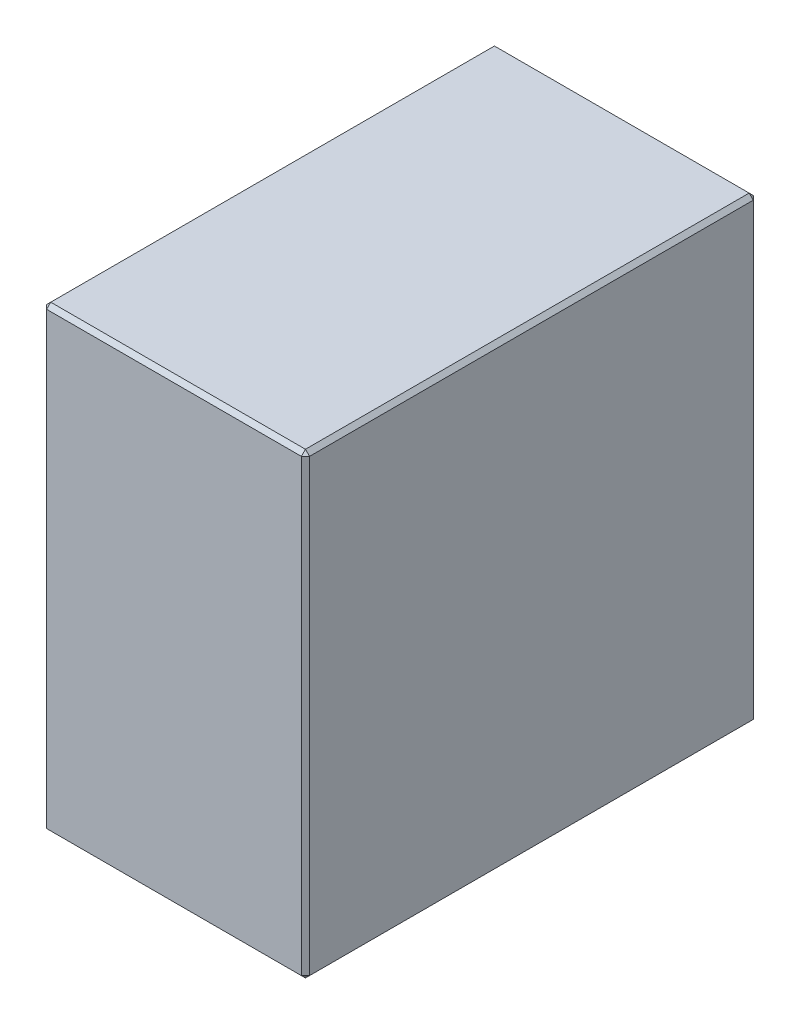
ISO-10303-21;
HEADER;
FILE_DESCRIPTION(('STEP AP214'),'2;1');
FILE_NAME('part.step','',(''),(''),'','','');
FILE_SCHEMA(('AUTOMOTIVE_DESIGN { 1 0 10303 214 1 1 1 1 }'));
ENDSEC;
DATA;
#1=APPLICATION_CONTEXT('core data for automotive mechanical design processes');
#2=APPLICATION_PROTOCOL_DEFINITION('international standard','automotive_design',2000,#1);
#3=PRODUCT_CONTEXT('',#1,'mechanical');
#4=PRODUCT('Part','Part','',(#3));
#5=PRODUCT_RELATED_PRODUCT_CATEGORY('part','',(#4));
#6=PRODUCT_DEFINITION_FORMATION('','',#4);
#7=PRODUCT_DEFINITION_CONTEXT('part definition',#1,'design');
#8=PRODUCT_DEFINITION('design','',#6,#7);
#9=PRODUCT_DEFINITION_SHAPE('','',#8);
#10=(LENGTH_UNIT() NAMED_UNIT(*) SI_UNIT(.MILLI.,.METRE.));
#11=(NAMED_UNIT(*) PLANE_ANGLE_UNIT() SI_UNIT($,.RADIAN.));
#12=(NAMED_UNIT(*) SI_UNIT($,.STERADIAN.) SOLID_ANGLE_UNIT());
#13=UNCERTAINTY_MEASURE_WITH_UNIT(LENGTH_MEASURE(1.E-05),#10,'distance_accuracy_value','');
#14=(GEOMETRIC_REPRESENTATION_CONTEXT(3) GLOBAL_UNCERTAINTY_ASSIGNED_CONTEXT((#13)) GLOBAL_UNIT_ASSIGNED_CONTEXT((#10,
#11,#12)) REPRESENTATION_CONTEXT('',''));
#15=CARTESIAN_POINT('',(0.,0.,0.));
#16=DIRECTION('',(0.,0.,1.));
#17=DIRECTION('',(1.,0.,0.));
#18=AXIS2_PLACEMENT_3D('',#15,#16,#17);
#19=CARTESIAN_POINT('',(27.,27.5,-27.5));
#20=DIRECTION('',(0.,-1.,0.));
#21=DIRECTION('',(0.,0.,-1.));
#22=AXIS2_PLACEMENT_3D('',#19,#20,#21);
#23=PLANE('',#22);
#24=DIRECTION('',(1.,0.,0.));
#25=VECTOR('',#24,1.);
#26=CARTESIAN_POINT('',(27.,27.5,27.));
#27=LINE('',#26,#25);
#28=CARTESIAN_POINT('',(-4.50000000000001,27.5,27.));
#29=VERTEX_POINT('',#28);
#30=CARTESIAN_POINT('',(26.5,27.5,27.));
#31=VERTEX_POINT('',#30);
#32=EDGE_CURVE('E412',#29,#31,#27,.T.);
#33=ORIENTED_EDGE('',*,*,#32,.T.);
#34=DIRECTION('',(0.,0.,-1.));
#35=VECTOR('',#34,1.);
#36=CARTESIAN_POINT('',(26.5,27.5,-27.5));
#37=LINE('',#36,#35);
#38=CARTESIAN_POINT('',(26.5,27.5,-27.));
#39=VERTEX_POINT('',#38);
#40=EDGE_CURVE('E415',#31,#39,#37,.T.);
#41=ORIENTED_EDGE('',*,*,#40,.T.);
#42=DIRECTION('',(-1.,0.,0.));
#43=VECTOR('',#42,1.);
#44=CARTESIAN_POINT('',(27.,27.5,-27.));
#45=LINE('',#44,#43);
#46=CARTESIAN_POINT('',(-4.50000000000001,27.5,-27.));
#47=VERTEX_POINT('',#46);
#48=EDGE_CURVE('E334',#39,#47,#45,.T.);
#49=ORIENTED_EDGE('',*,*,#48,.T.);
#50=DIRECTION('',(0.,0.,1.));
#51=VECTOR('',#50,1.);
#52=CARTESIAN_POINT('',(-4.50000000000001,27.5,-27.5));
#53=LINE('',#52,#51);
#54=EDGE_CURVE('E416',#47,#29,#53,.T.);
#55=ORIENTED_EDGE('',*,*,#54,.T.);
#56=EDGE_LOOP('',(#33,#41,#49,#55));
#57=FACE_BOUND('',#56,.T.);
#58=ADVANCED_FACE('F31',(#57),#23,.F.);
#59=CARTESIAN_POINT('',(27.,-0.870419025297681,27.5));
#60=DIRECTION('',(0.,0.,-1.));
#61=DIRECTION('',(-1.,0.,0.));
#62=AXIS2_PLACEMENT_3D('',#59,#60,#61);
#63=PLANE('',#62);
#64=DIRECTION('',(1.,0.,0.));
#65=VECTOR('',#64,1.);
#66=CARTESIAN_POINT('',(27.,-27.7295705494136,27.5));
#67=LINE('',#66,#65);
#68=CARTESIAN_POINT('',(-4.50000000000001,-27.7295705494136,27.5));
#69=VERTEX_POINT('',#68);
#70=CARTESIAN_POINT('',(26.5,-27.7295705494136,27.5));
#71=VERTEX_POINT('',#70);
#72=EDGE_CURVE('E312',#69,#71,#67,.T.);
#73=ORIENTED_EDGE('',*,*,#72,.T.);
#74=DIRECTION('',(0.,1.,0.));
#75=VECTOR('',#74,1.);
#76=CARTESIAN_POINT('',(26.5,27.5,27.5));
#77=LINE('',#76,#75);
#78=CARTESIAN_POINT('',(26.5,27.,27.5));
#79=VERTEX_POINT('',#78);
#80=EDGE_CURVE('E178',#71,#79,#77,.T.);
#81=ORIENTED_EDGE('',*,*,#80,.T.);
#82=DIRECTION('',(-1.,0.,0.));
#83=VECTOR('',#82,1.);
#84=CARTESIAN_POINT('',(27.,27.,27.5));
#85=LINE('',#84,#83);
#86=CARTESIAN_POINT('',(-4.50000000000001,27.,27.5));
#87=VERTEX_POINT('',#86);
#88=EDGE_CURVE('E378',#79,#87,#85,.T.);
#89=ORIENTED_EDGE('',*,*,#88,.T.);
#90=DIRECTION('',(0.,-1.,0.));
#91=VECTOR('',#90,1.);
#92=CARTESIAN_POINT('',(-4.50000000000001,-0.870419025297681,27.5));
#93=LINE('',#92,#91);
#94=EDGE_CURVE('E314',#87,#69,#93,.T.);
#95=ORIENTED_EDGE('',*,*,#94,.T.);
#96=EDGE_LOOP('',(#73,#81,#89,#95));
#97=FACE_BOUND('',#96,.T.);
#98=ADVANCED_FACE('F303',(#97),#63,.F.);
#99=CARTESIAN_POINT('',(27.,-28.2295705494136,-27.5));
#100=DIRECTION('',(0.,1.,0.));
#101=DIRECTION('',(0.,0.,1.));
#102=AXIS2_PLACEMENT_3D('',#99,#100,#101);
#103=PLANE('',#102);
#104=DIRECTION('',(1.,0.,0.));
#105=VECTOR('',#104,1.);
#106=CARTESIAN_POINT('',(27.,-28.2295705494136,-27.));
#107=LINE('',#106,#105);
#108=CARTESIAN_POINT('',(-4.50000000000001,-28.2295705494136,-27.));
#109=VERTEX_POINT('',#108);
#110=CARTESIAN_POINT('',(26.5,-28.2295705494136,-27.));
#111=VERTEX_POINT('',#110);
#112=EDGE_CURVE('E370',#109,#111,#107,.T.);
#113=ORIENTED_EDGE('',*,*,#112,.T.);
#114=DIRECTION('',(0.,0.,1.));
#115=VECTOR('',#114,1.);
#116=CARTESIAN_POINT('',(26.5,-28.2295705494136,27.5));
#117=LINE('',#116,#115);
#118=CARTESIAN_POINT('',(26.5,-28.2295705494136,27.));
#119=VERTEX_POINT('',#118);
#120=EDGE_CURVE('E391',#111,#119,#117,.T.);
#121=ORIENTED_EDGE('',*,*,#120,.T.);
#122=DIRECTION('',(-1.,0.,0.));
#123=VECTOR('',#122,1.);
#124=CARTESIAN_POINT('',(27.,-28.2295705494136,27.));
#125=LINE('',#124,#123);
#126=CARTESIAN_POINT('',(-4.50000000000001,-28.2295705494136,27.));
#127=VERTEX_POINT('',#126);
#128=EDGE_CURVE('E318',#119,#127,#125,.T.);
#129=ORIENTED_EDGE('',*,*,#128,.T.);
#130=DIRECTION('',(0.,0.,-1.));
#131=VECTOR('',#130,1.);
#132=CARTESIAN_POINT('',(-4.50000000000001,-28.2295705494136,-27.5));
#133=LINE('',#132,#131);
#134=EDGE_CURVE('E387',#127,#109,#133,.T.);
#135=ORIENTED_EDGE('',*,*,#134,.T.);
#136=EDGE_LOOP('',(#113,#121,#129,#135));
#137=FACE_BOUND('',#136,.T.);
#138=ADVANCED_FACE('F300',(#137),#103,.F.);
#139=CARTESIAN_POINT('',(27.,-0.89256496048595,-27.5));
#140=DIRECTION('',(0.,0.,1.));
#141=DIRECTION('',(0.,-1.,0.));
#142=AXIS2_PLACEMENT_3D('',#139,#140,#141);
#143=PLANE('',#142);
#144=DIRECTION('',(-1.,0.,0.));
#145=VECTOR('',#144,1.);
#146=CARTESIAN_POINT('',(27.,-0.89256496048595,-27.5));
#147=LINE('',#146,#145);
#148=CARTESIAN_POINT('',(26.5,-0.89256496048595,-27.5));
#149=VERTEX_POINT('',#148);
#150=CARTESIAN_POINT('',(-4.50000000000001,-0.89256496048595,-27.5));
#151=VERTEX_POINT('',#150);
#152=EDGE_CURVE('E165',#149,#151,#147,.T.);
#153=ORIENTED_EDGE('',*,*,#152,.F.);
#154=DIRECTION('',(0.,-1.,0.));
#155=VECTOR('',#154,1.);
#156=CARTESIAN_POINT('',(26.5,-28.2295705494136,-27.5));
#157=LINE('',#156,#155);
#158=CARTESIAN_POINT('',(26.5,-27.7295705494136,-27.5));
#159=VERTEX_POINT('',#158);
#160=EDGE_CURVE('E375',#149,#159,#157,.T.);
#161=ORIENTED_EDGE('',*,*,#160,.T.);
#162=DIRECTION('',(-1.,0.,0.));
#163=VECTOR('',#162,1.);
#164=CARTESIAN_POINT('',(27.,-27.7295705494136,-27.5));
#165=LINE('',#164,#163);
#166=CARTESIAN_POINT('',(-4.50000000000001,-27.7295705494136,-27.5));
#167=VERTEX_POINT('',#166);
#168=EDGE_CURVE('E371',#159,#167,#165,.T.);
#169=ORIENTED_EDGE('',*,*,#168,.T.);
#170=DIRECTION('',(0.,1.,0.));
#171=VECTOR('',#170,1.);
#172=CARTESIAN_POINT('',(-4.50000000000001,-0.89256496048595,-27.5));
#173=LINE('',#172,#171);
#174=EDGE_CURVE('E376',#167,#151,#173,.T.);
#175=ORIENTED_EDGE('',*,*,#174,.T.);
#176=EDGE_LOOP('',(#153,#161,#169,#175));
#177=FACE_BOUND('',#176,.T.);
#178=ADVANCED_FACE('F296',(#177),#143,.F.);
#179=CARTESIAN_POINT('',(27.,0.0789321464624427,-0.0171654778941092));
#180=DIRECTION('',(-1.,0.,0.));
#181=DIRECTION('',(0.,0.,1.));
#182=AXIS2_PLACEMENT_3D('',#179,#180,#181);
#183=CYLINDRICAL_SURFACE('',#182,27.4999999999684);
#184=DIRECTION('',(-1.,0.,0.));
#185=VECTOR('',#184,1.);
#186=CARTESIAN_POINT('',(27.,1.05042925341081,-27.5));
#187=LINE('',#186,#185);
#188=CARTESIAN_POINT('',(26.5,1.05042925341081,-27.5));
#189=VERTEX_POINT('',#188);
#190=CARTESIAN_POINT('',(-4.5,1.05042925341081,-27.5));
#191=VERTEX_POINT('',#190);
#192=EDGE_CURVE('E434',#189,#191,#187,.T.);
#193=ORIENTED_EDGE('',*,*,#192,.F.);
#194=CARTESIAN_POINT('',(26.5,0.0789321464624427,-0.0171654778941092));
#195=DIRECTION('',(1.,0.,0.));
#196=DIRECTION('',(0.,0.,-1.));
#197=AXIS2_PLACEMENT_3D('',#194,#195,#196);
#198=CIRCLE('',#197,27.4999999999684);
#199=EDGE_CURVE('E380',#189,#149,#198,.F.);
#200=ORIENTED_EDGE('',*,*,#199,.T.);
#201=ORIENTED_EDGE('',*,*,#152,.T.);
#202=CARTESIAN_POINT('',(-4.50000000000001,0.0789321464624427,-0.0171654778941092));
#203=DIRECTION('',(1.,0.,0.));
#204=DIRECTION('',(0.,0.,-1.));
#205=AXIS2_PLACEMENT_3D('',#202,#203,#204);
#206=CIRCLE('',#205,27.4999999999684);
#207=EDGE_CURVE('E428',#151,#191,#206,.T.);
#208=ORIENTED_EDGE('',*,*,#207,.T.);
#209=EDGE_LOOP('',(#193,#200,#201,#208));
#210=FACE_BOUND('',#209,.T.);
#211=ADVANCED_FACE('F292',(#210),#183,.T.);
#212=CARTESIAN_POINT('',(27.,1.05042925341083,-27.5));
#213=DIRECTION('',(0.,0.,1.));
#214=DIRECTION('',(1.,0.,0.));
#215=AXIS2_PLACEMENT_3D('',#212,#213,#214);
#216=PLANE('',#215);
#217=DIRECTION('',(1.,0.,0.));
#218=VECTOR('',#217,1.);
#219=CARTESIAN_POINT('',(27.,27.,-27.5));
#220=LINE('',#219,#218);
#221=CARTESIAN_POINT('',(-4.5,27.,-27.5));
#222=VERTEX_POINT('',#221);
#223=CARTESIAN_POINT('',(26.5,27.,-27.5));
#224=VERTEX_POINT('',#223);
#225=EDGE_CURVE('E336',#222,#224,#220,.T.);
#226=ORIENTED_EDGE('',*,*,#225,.T.);
#227=DIRECTION('',(0.,-1.,0.));
#228=VECTOR('',#227,1.);
#229=CARTESIAN_POINT('',(26.5,1.05042925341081,-27.5));
#230=LINE('',#229,#228);
#231=EDGE_CURVE('E425',#224,#189,#230,.T.);
#232=ORIENTED_EDGE('',*,*,#231,.T.);
#233=ORIENTED_EDGE('',*,*,#192,.T.);
#234=DIRECTION('',(0.,1.,0.));
#235=VECTOR('',#234,1.);
#236=CARTESIAN_POINT('',(-4.5,1.05042925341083,-27.5));
#237=LINE('',#236,#235);
#238=EDGE_CURVE('E423',#191,#222,#237,.T.);
#239=ORIENTED_EDGE('',*,*,#238,.T.);
#240=EDGE_LOOP('',(#226,#232,#233,#239));
#241=FACE_BOUND('',#240,.T.);
#242=ADVANCED_FACE('F289',(#241),#216,.F.);
#243=CARTESIAN_POINT('',(27.,0.0789321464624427,-0.0171654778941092));
#244=DIRECTION('',(1.,0.,0.));
#245=DIRECTION('',(0.,0.,-1.));
#246=AXIS2_PLACEMENT_3D('',#243,#244,#245);
#247=PLANE('',#246);
#248=DIRECTION('',(0.,1.,0.));
#249=VECTOR('',#248,1.);
#250=CARTESIAN_POINT('',(27.,27.5,-27.));
#251=LINE('',#250,#249);
#252=CARTESIAN_POINT('',(27.,1.04155416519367,-27.));
#253=VERTEX_POINT('',#252);
#254=CARTESIAN_POINT('',(27.,27.,-27.));
#255=VERTEX_POINT('',#254);
#256=EDGE_CURVE('E442',#253,#255,#251,.T.);
#257=ORIENTED_EDGE('',*,*,#256,.T.);
#258=DIRECTION('',(0.,0.,1.));
#259=VECTOR('',#258,1.);
#260=CARTESIAN_POINT('',(27.,27.,27.5));
#261=LINE('',#260,#259);
#262=CARTESIAN_POINT('',(27.,27.,27.));
#263=VERTEX_POINT('',#262);
#264=EDGE_CURVE('E149',#255,#263,#261,.T.);
#265=ORIENTED_EDGE('',*,*,#264,.T.);
#266=DIRECTION('',(0.,-1.,0.));
#267=VECTOR('',#266,1.);
#268=CARTESIAN_POINT('',(27.,-28.2295705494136,27.));
#269=LINE('',#268,#267);
#270=CARTESIAN_POINT('',(27.,-27.7295705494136,27.));
#271=VERTEX_POINT('',#270);
#272=EDGE_CURVE('E143',#263,#271,#269,.T.);
#273=ORIENTED_EDGE('',*,*,#272,.T.);
#274=DIRECTION('',(0.,0.,-1.));
#275=VECTOR('',#274,1.);
#276=CARTESIAN_POINT('',(27.,-27.7295705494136,-27.5));
#277=LINE('',#276,#275);
#278=CARTESIAN_POINT('',(27.,-27.7295705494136,-27.));
#279=VERTEX_POINT('',#278);
#280=EDGE_CURVE('E146',#271,#279,#277,.T.);
#281=ORIENTED_EDGE('',*,*,#280,.T.);
#282=DIRECTION('',(0.,1.,0.));
#283=VECTOR('',#282,1.);
#284=CARTESIAN_POINT('',(27.,-0.89256496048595,-27.));
#285=LINE('',#284,#283);
#286=CARTESIAN_POINT('',(27.,-0.883689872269,-27.));
#287=VERTEX_POINT('',#286);
#288=EDGE_CURVE('E153',#279,#287,#285,.T.);
#289=ORIENTED_EDGE('',*,*,#288,.T.);
#290=CARTESIAN_POINT('',(27.,0.0789321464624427,-0.0171654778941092));
#291=DIRECTION('',(1.,0.,0.));
#292=DIRECTION('',(0.,0.,-1.));
#293=AXIS2_PLACEMENT_3D('',#290,#291,#292);
#294=CIRCLE('',#293,26.9999999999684);
#295=EDGE_CURVE('E440',#287,#253,#294,.T.);
#296=ORIENTED_EDGE('',*,*,#295,.T.);
#297=EDGE_LOOP('',(#257,#265,#273,#281,#289,#296));
#298=FACE_BOUND('',#297,.T.);
#299=ADVANCED_FACE('F145',(#298),#247,.T.);
#300=CARTESIAN_POINT('',(-5.,0.0789321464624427,-0.0171654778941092));
#301=DIRECTION('',(1.,0.,0.));
#302=DIRECTION('',(0.,0.,-1.));
#303=AXIS2_PLACEMENT_3D('',#300,#301,#302);
#304=PLANE('',#303);
#305=DIRECTION('',(0.,-1.,0.));
#306=VECTOR('',#305,1.);
#307=CARTESIAN_POINT('',(-5.,0.0789321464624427,-27.));
#308=LINE('',#307,#306);
#309=CARTESIAN_POINT('',(-5.,27.,-27.));
#310=VERTEX_POINT('',#309);
#311=CARTESIAN_POINT('',(-5.,1.04155416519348,-27.));
#312=VERTEX_POINT('',#311);
#313=EDGE_CURVE('E393',#310,#312,#308,.T.);
#314=ORIENTED_EDGE('',*,*,#313,.T.);
#315=CARTESIAN_POINT('',(-5.,0.0789321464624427,-0.0171654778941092));
#316=DIRECTION('',(1.,0.,0.));
#317=DIRECTION('',(0.,0.,-1.));
#318=AXIS2_PLACEMENT_3D('',#315,#316,#317);
#319=CIRCLE('',#318,26.9999999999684);
#320=CARTESIAN_POINT('',(-5.,-0.883689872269,-27.));
#321=VERTEX_POINT('',#320);
#322=EDGE_CURVE('E11',#312,#321,#319,.F.);
#323=ORIENTED_EDGE('',*,*,#322,.T.);
#324=DIRECTION('',(0.,-1.,0.));
#325=VECTOR('',#324,1.);
#326=CARTESIAN_POINT('',(-5.,0.0789321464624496,-27.));
#327=LINE('',#326,#325);
#328=CARTESIAN_POINT('',(-5.,-27.7295705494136,-27.));
#329=VERTEX_POINT('',#328);
#330=EDGE_CURVE('E38',#321,#329,#327,.T.);
#331=ORIENTED_EDGE('',*,*,#330,.T.);
#332=DIRECTION('',(0.,0.,1.));
#333=VECTOR('',#332,1.);
#334=CARTESIAN_POINT('',(-5.,-27.7295705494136,-0.0171654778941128));
#335=LINE('',#334,#333);
#336=CARTESIAN_POINT('',(-5.,-27.7295705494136,27.));
#337=VERTEX_POINT('',#336);
#338=EDGE_CURVE('E399',#329,#337,#335,.T.);
#339=ORIENTED_EDGE('',*,*,#338,.T.);
#340=DIRECTION('',(0.,1.,0.));
#341=VECTOR('',#340,1.);
#342=CARTESIAN_POINT('',(-5.,0.0789321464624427,27.));
#343=LINE('',#342,#341);
#344=CARTESIAN_POINT('',(-5.,27.,27.));
#345=VERTEX_POINT('',#344);
#346=EDGE_CURVE('E397',#337,#345,#343,.T.);
#347=ORIENTED_EDGE('',*,*,#346,.T.);
#348=DIRECTION('',(0.,0.,-1.));
#349=VECTOR('',#348,1.);
#350=CARTESIAN_POINT('',(-5.,27.,-0.0171654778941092));
#351=LINE('',#350,#349);
#352=EDGE_CURVE('E395',#345,#310,#351,.T.);
#353=ORIENTED_EDGE('',*,*,#352,.T.);
#354=EDGE_LOOP('',(#314,#323,#331,#339,#347,#353));
#355=FACE_BOUND('',#354,.T.);
#356=ADVANCED_FACE('F283',(#355),#304,.F.);
#357=CARTESIAN_POINT('',(-4.50000000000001,-27.7295705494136,-27.5));
#358=DIRECTION('',(-0.577350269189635,-0.577350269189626,-0.577350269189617));
#359=DIRECTION('',(0.707106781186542,-0.707106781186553,0.));
#360=AXIS2_PLACEMENT_3D('',#357,#358,#359);
#361=PLANE('',#360);
#362=DIRECTION('',(0.707106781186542,-0.707106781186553,0.));
#363=VECTOR('',#362,1.);
#364=CARTESIAN_POINT('',(-4.75,-27.9795705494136,-27.));
#365=LINE('',#364,#363);
#366=EDGE_CURVE('E264',#329,#109,#365,.T.);
#367=ORIENTED_EDGE('',*,*,#366,.F.);
#368=DIRECTION('',(-0.707106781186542,0.,0.707106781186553));
#369=VECTOR('',#368,1.);
#370=CARTESIAN_POINT('',(-4.50000000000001,-27.7295705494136,-27.5));
#371=LINE('',#370,#369);
#372=EDGE_CURVE('E448',#167,#329,#371,.T.);
#373=ORIENTED_EDGE('',*,*,#372,.F.);
#374=DIRECTION('',(0.,0.707106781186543,-0.707106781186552));
#375=VECTOR('',#374,1.);
#376=CARTESIAN_POINT('',(-4.50000000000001,-27.7295705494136,-27.5));
#377=LINE('',#376,#375);
#378=EDGE_CURVE('E373',#109,#167,#377,.T.);
#379=ORIENTED_EDGE('',*,*,#378,.F.);
#380=EDGE_LOOP('',(#367,#373,#379));
#381=FACE_BOUND('',#380,.T.);
#382=ADVANCED_FACE('F273',(#381),#361,.T.);
#383=CARTESIAN_POINT('',(-4.50000000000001,-0.89256496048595,-27.5));
#384=DIRECTION('',(0.707106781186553,0.,0.707106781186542));
#385=DIRECTION('',(0.707106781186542,0.,-0.707106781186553));
#386=AXIS2_PLACEMENT_3D('',#383,#384,#385);
#387=PLANE('',#386);
#388=ORIENTED_EDGE('',*,*,#372,.T.);
#389=ORIENTED_EDGE('',*,*,#330,.F.);
#390=CARTESIAN_POINT('',(-5.,-0.883689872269,-27.));
#391=CARTESIAN_POINT('',(-4.91666672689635,-0.885175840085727,-27.0833332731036));
#392=CARTESIAN_POINT('',(-4.83333342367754,-0.886658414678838,-27.1666665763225));
#393=CARTESIAN_POINT('',(-4.66666675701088,-0.889616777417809,-27.3333332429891));
#394=CARTESIAN_POINT('',(-4.58333339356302,-0.891092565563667,-27.416666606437));
#395=CARTESIAN_POINT('',(-4.50000000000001,-0.892564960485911,-27.5));
#396=B_SPLINE_CURVE_WITH_KNOTS('',3,(#390,#391,#392,#393,#394,#395),.UNSPECIFIED.,.F.,.F.,(4,2,
4),(0.,0.353581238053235,0.70716247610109),.UNSPECIFIED.);
#397=EDGE_CURVE('E45',#151,#321,#396,.F.);
#398=ORIENTED_EDGE('',*,*,#397,.F.);
#399=ORIENTED_EDGE('',*,*,#174,.F.);
#400=EDGE_LOOP('',(#388,#389,#398,#399));
#401=FACE_BOUND('',#400,.T.);
#402=ADVANCED_FACE('F267',(#401),#387,.F.);
#403=CARTESIAN_POINT('',(27.,-27.7295705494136,-27.5));
#404=DIRECTION('',(0.,0.707106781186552,0.707106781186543));
#405=DIRECTION('',(0.,-0.707106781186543,0.707106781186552));
#406=AXIS2_PLACEMENT_3D('',#403,#404,#405);
#407=PLANE('',#406);
#408=ORIENTED_EDGE('',*,*,#378,.T.);
#409=ORIENTED_EDGE('',*,*,#168,.F.);
#410=DIRECTION('',(0.,-0.707106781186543,0.707106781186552));
#411=VECTOR('',#410,1.);
#412=CARTESIAN_POINT('',(26.5,-27.7295705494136,-27.5));
#413=LINE('',#412,#411);
#414=EDGE_CURVE('E265',#111,#159,#413,.F.);
#415=ORIENTED_EDGE('',*,*,#414,.F.);
#416=ORIENTED_EDGE('',*,*,#112,.F.);
#417=EDGE_LOOP('',(#408,#409,#415,#416));
#418=FACE_BOUND('',#417,.T.);
#419=ADVANCED_FACE('F272',(#418),#407,.F.);
#420=CARTESIAN_POINT('',(-4.50000000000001,-28.2295705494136,-27.5));
#421=DIRECTION('',(0.707106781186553,0.707106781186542,0.));
#422=DIRECTION('',(-0.707106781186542,0.707106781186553,0.));
#423=AXIS2_PLACEMENT_3D('',#420,#421,#422);
#424=PLANE('',#423);
#425=ORIENTED_EDGE('',*,*,#366,.T.);
#426=ORIENTED_EDGE('',*,*,#134,.F.);
#427=DIRECTION('',(-0.707106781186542,0.707106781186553,0.));
#428=VECTOR('',#427,1.);
#429=CARTESIAN_POINT('',(-4.50000000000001,-28.2295705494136,27.));
#430=LINE('',#429,#428);
#431=EDGE_CURVE('E354',#337,#127,#430,.F.);
#432=ORIENTED_EDGE('',*,*,#431,.F.);
#433=ORIENTED_EDGE('',*,*,#338,.F.);
#434=EDGE_LOOP('',(#425,#426,#432,#433));
#435=FACE_BOUND('',#434,.T.);
#436=ADVANCED_FACE('F246',(#435),#424,.F.);
#437=CARTESIAN_POINT('',(-4.50000000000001,0.0789321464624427,-0.0171654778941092));
#438=DIRECTION('',(1.,0.,0.));
#439=DIRECTION('',(0.,0.,-1.));
#440=AXIS2_PLACEMENT_3D('',#437,#438,#439);
#441=CONICAL_SURFACE('',#440,27.4999999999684,0.785398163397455);
#442=ORIENTED_EDGE('',*,*,#397,.T.);
#443=ORIENTED_EDGE('',*,*,#322,.F.);
#444=CARTESIAN_POINT('',(-4.5,1.05042925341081,-27.5));
#445=CARTESIAN_POINT('',(-4.58333339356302,1.04895685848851,-27.416666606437));
#446=CARTESIAN_POINT('',(-4.66666675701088,1.04748107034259,-27.3333332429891));
#447=CARTESIAN_POINT('',(-4.83333342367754,1.04452270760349,-27.1666665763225));
#448=CARTESIAN_POINT('',(-4.91666672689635,1.04304013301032,-27.0833332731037));
#449=CARTESIAN_POINT('',(-5.,1.04155416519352,-27.));
#450=B_SPLINE_CURVE_WITH_KNOTS('',3,(#444,#445,#446,#447,#448,#449),.UNSPECIFIED.,.F.,.F.,(4,2,
4),(0.,0.353581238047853,0.707162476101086),.UNSPECIFIED.);
#451=EDGE_CURVE('E251',#191,#312,#450,.T.);
#452=ORIENTED_EDGE('',*,*,#451,.F.);
#453=ORIENTED_EDGE('',*,*,#207,.F.);
#454=EDGE_LOOP('',(#442,#443,#452,#453));
#455=FACE_BOUND('',#454,.T.);
#456=ADVANCED_FACE('F241',(#455),#441,.T.);
#457=CARTESIAN_POINT('',(26.5,-27.7295705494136,-27.5));
#458=DIRECTION('',(0.577350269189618,-0.577350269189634,-0.577350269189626));
#459=DIRECTION('',(0.,0.707106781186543,-0.707106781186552));
#460=AXIS2_PLACEMENT_3D('',#457,#458,#459);
#461=PLANE('',#460);
#462=DIRECTION('',(-0.707106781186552,-0.707106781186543,0.));
#463=VECTOR('',#462,1.);
#464=CARTESIAN_POINT('',(26.75,-27.9795705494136,-27.));
#465=LINE('',#464,#463);
#466=EDGE_CURVE('E163',#111,#279,#465,.F.);
#467=ORIENTED_EDGE('',*,*,#466,.F.);
#468=ORIENTED_EDGE('',*,*,#414,.T.);
#469=DIRECTION('',(0.707106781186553,0.,0.707106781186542));
#470=VECTOR('',#469,1.);
#471=CARTESIAN_POINT('',(26.5,-27.7295705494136,-27.5));
#472=LINE('',#471,#470);
#473=EDGE_CURVE('E349',#279,#159,#472,.F.);
#474=ORIENTED_EDGE('',*,*,#473,.F.);
#475=EDGE_LOOP('',(#467,#468,#474));
#476=FACE_BOUND('',#475,.T.);
#477=ADVANCED_FACE('F245',(#476),#461,.T.);
#478=CARTESIAN_POINT('',(-4.50000000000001,-28.2295705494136,27.));
#479=DIRECTION('',(-0.577350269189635,-0.577350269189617,0.577350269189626));
#480=DIRECTION('',(0.707106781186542,0.,0.707106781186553));
#481=AXIS2_PLACEMENT_3D('',#478,#479,#480);
#482=PLANE('',#481);
#483=DIRECTION('',(0.707106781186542,0.,0.707106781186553));
#484=VECTOR('',#483,1.);
#485=CARTESIAN_POINT('',(-4.75,-27.7295705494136,27.25));
#486=LINE('',#485,#484);
#487=EDGE_CURVE('E344',#337,#69,#486,.T.);
#488=ORIENTED_EDGE('',*,*,#487,.F.);
#489=ORIENTED_EDGE('',*,*,#431,.T.);
#490=DIRECTION('',(0.,-0.707106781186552,-0.707106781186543));
#491=VECTOR('',#490,1.);
#492=CARTESIAN_POINT('',(-4.50000000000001,-28.2295705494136,27.));
#493=LINE('',#492,#491);
#494=EDGE_CURVE('E345',#69,#127,#493,.T.);
#495=ORIENTED_EDGE('',*,*,#494,.F.);
#496=EDGE_LOOP('',(#488,#489,#495));
#497=FACE_BOUND('',#496,.T.);
#498=ADVANCED_FACE('F404',(#497),#482,.T.);
#499=CARTESIAN_POINT('',(-4.5,1.05042925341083,-27.5));
#500=DIRECTION('',(0.707106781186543,0.,0.707106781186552));
#501=DIRECTION('',(0.707106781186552,0.,-0.707106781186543));
#502=AXIS2_PLACEMENT_3D('',#499,#500,#501);
#503=PLANE('',#502);
#504=ORIENTED_EDGE('',*,*,#451,.T.);
#505=ORIENTED_EDGE('',*,*,#313,.F.);
#506=DIRECTION('',(0.707106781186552,0.,-0.707106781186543));
#507=VECTOR('',#506,1.);
#508=CARTESIAN_POINT('',(-5.,27.,-27.));
#509=LINE('',#508,#507);
#510=EDGE_CURVE('E214',#222,#310,#509,.F.);
#511=ORIENTED_EDGE('',*,*,#510,.F.);
#512=ORIENTED_EDGE('',*,*,#238,.F.);
#513=EDGE_LOOP('',(#504,#505,#511,#512));
#514=FACE_BOUND('',#513,.T.);
#515=ADVANCED_FACE('F222',(#514),#503,.F.);
#516=CARTESIAN_POINT('',(27.,0.0789321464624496,-27.));
#517=DIRECTION('',(0.707106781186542,0.,-0.707106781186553));
#518=DIRECTION('',(-0.707106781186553,0.,-0.707106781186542));
#519=AXIS2_PLACEMENT_3D('',#516,#517,#518);
#520=PLANE('',#519);
#521=ORIENTED_EDGE('',*,*,#473,.T.);
#522=ORIENTED_EDGE('',*,*,#160,.F.);
#523=CARTESIAN_POINT('',(26.5,-0.89256496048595,-27.5));
#524=CARTESIAN_POINT('',(26.583333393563,-0.891092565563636,-27.416666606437));
#525=CARTESIAN_POINT('',(26.6666667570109,-0.889616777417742,-27.3333332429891));
#526=CARTESIAN_POINT('',(26.8333334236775,-0.886658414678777,-27.1666665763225));
#527=CARTESIAN_POINT('',(26.9166667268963,-0.885175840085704,-27.0833332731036));
#528=CARTESIAN_POINT('',(27.,-0.883689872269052,-27.));
#529=B_SPLINE_CURVE_WITH_KNOTS('',3,(#523,#524,#525,#526,#527,#528),.UNSPECIFIED.,.F.,.F.,(4,2,
4),(0.,0.353581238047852,0.707162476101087),.UNSPECIFIED.);
#530=EDGE_CURVE('E174',#287,#149,#529,.F.);
#531=ORIENTED_EDGE('',*,*,#530,.F.);
#532=ORIENTED_EDGE('',*,*,#288,.F.);
#533=EDGE_LOOP('',(#521,#522,#531,#532));
#534=FACE_BOUND('',#533,.T.);
#535=ADVANCED_FACE('F217',(#534),#520,.T.);
#536=CARTESIAN_POINT('',(27.,-27.7295705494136,-0.0171654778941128));
#537=DIRECTION('',(0.707106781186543,-0.707106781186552,0.));
#538=DIRECTION('',(0.707106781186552,0.707106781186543,0.));
#539=AXIS2_PLACEMENT_3D('',#536,#537,#538);
#540=PLANE('',#539);
#541=ORIENTED_EDGE('',*,*,#466,.T.);
#542=ORIENTED_EDGE('',*,*,#280,.F.);
#543=DIRECTION('',(0.707106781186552,0.707106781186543,0.));
#544=VECTOR('',#543,1.);
#545=CARTESIAN_POINT('',(27.,-27.7295705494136,27.));
#546=LINE('',#545,#544);
#547=EDGE_CURVE('E160',#119,#271,#546,.T.);
#548=ORIENTED_EDGE('',*,*,#547,.F.);
#549=ORIENTED_EDGE('',*,*,#120,.F.);
#550=EDGE_LOOP('',(#541,#542,#548,#549));
#551=FACE_BOUND('',#550,.T.);
#552=ADVANCED_FACE('F158',(#551),#540,.T.);
#553=CARTESIAN_POINT('',(27.,-28.2295705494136,27.));
#554=DIRECTION('',(0.,0.707106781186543,-0.707106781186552));
#555=DIRECTION('',(0.,0.707106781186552,0.707106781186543));
#556=AXIS2_PLACEMENT_3D('',#553,#554,#555);
#557=PLANE('',#556);
#558=ORIENTED_EDGE('',*,*,#494,.T.);
#559=ORIENTED_EDGE('',*,*,#128,.F.);
#560=DIRECTION('',(0.,0.707106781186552,0.707106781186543));
#561=VECTOR('',#560,1.);
#562=CARTESIAN_POINT('',(26.5,-27.9795705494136,27.25));
#563=LINE('',#562,#561);
#564=EDGE_CURVE('E173',#71,#119,#563,.F.);
#565=ORIENTED_EDGE('',*,*,#564,.F.);
#566=ORIENTED_EDGE('',*,*,#72,.F.);
#567=EDGE_LOOP('',(#558,#559,#565,#566));
#568=FACE_BOUND('',#567,.T.);
#569=ADVANCED_FACE('F234',(#568),#557,.F.);
#570=CARTESIAN_POINT('',(-4.50000000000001,-0.870419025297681,27.5));
#571=DIRECTION('',(0.707106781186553,0.,-0.707106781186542));
#572=DIRECTION('',(-0.707106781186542,0.,-0.707106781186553));
#573=AXIS2_PLACEMENT_3D('',#570,#571,#572);
#574=PLANE('',#573);
#575=ORIENTED_EDGE('',*,*,#487,.T.);
#576=ORIENTED_EDGE('',*,*,#94,.F.);
#577=DIRECTION('',(-0.707106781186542,0.,-0.707106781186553));
#578=VECTOR('',#577,1.);
#579=CARTESIAN_POINT('',(-5.,27.,27.));
#580=LINE('',#579,#578);
#581=EDGE_CURVE('E320',#345,#87,#580,.F.);
#582=ORIENTED_EDGE('',*,*,#581,.F.);
#583=ORIENTED_EDGE('',*,*,#346,.F.);
#584=EDGE_LOOP('',(#575,#576,#582,#583));
#585=FACE_BOUND('',#584,.T.);
#586=ADVANCED_FACE('F230',(#585),#574,.F.);
#587=CARTESIAN_POINT('',(-4.50000000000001,27.5,-27.5));
#588=DIRECTION('',(0.707106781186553,-0.707106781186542,0.));
#589=DIRECTION('',(0.707106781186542,0.707106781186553,0.));
#590=AXIS2_PLACEMENT_3D('',#587,#588,#589);
#591=PLANE('',#590);
#592=DIRECTION('',(-0.707106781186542,-0.707106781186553,0.));
#593=VECTOR('',#592,1.);
#594=CARTESIAN_POINT('',(-5.,27.,-27.));
#595=LINE('',#594,#593);
#596=EDGE_CURVE('E341',#310,#47,#595,.F.);
#597=ORIENTED_EDGE('',*,*,#596,.F.);
#598=ORIENTED_EDGE('',*,*,#352,.F.);
#599=DIRECTION('',(0.707106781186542,0.707106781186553,0.));
#600=VECTOR('',#599,1.);
#601=CARTESIAN_POINT('',(-5.,27.,27.));
#602=LINE('',#601,#600);
#603=EDGE_CURVE('E322',#29,#345,#602,.F.);
#604=ORIENTED_EDGE('',*,*,#603,.F.);
#605=ORIENTED_EDGE('',*,*,#54,.F.);
#606=EDGE_LOOP('',(#597,#598,#604,#605));
#607=FACE_BOUND('',#606,.T.);
#608=ADVANCED_FACE('F226',(#607),#591,.F.);
#609=CARTESIAN_POINT('',(-5.,27.,-27.));
#610=DIRECTION('',(-0.577350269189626,0.577350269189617,-0.577350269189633));
#611=DIRECTION('',(-0.707106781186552,0.,0.707106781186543));
#612=AXIS2_PLACEMENT_3D('',#609,#610,#611);
#613=PLANE('',#612);
#614=ORIENTED_EDGE('',*,*,#510,.T.);
#615=ORIENTED_EDGE('',*,*,#596,.T.);
#616=DIRECTION('',(0.,0.707106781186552,0.707106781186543));
#617=VECTOR('',#616,1.);
#618=CARTESIAN_POINT('',(-4.5,27.25,-27.25));
#619=LINE('',#618,#617);
#620=EDGE_CURVE('E182',#222,#47,#619,.T.);
#621=ORIENTED_EDGE('',*,*,#620,.F.);
#622=EDGE_LOOP('',(#614,#615,#621));
#623=FACE_BOUND('',#622,.T.);
#624=ADVANCED_FACE('F202',(#623),#613,.T.);
#625=CARTESIAN_POINT('',(27.,0.0789321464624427,-0.0171654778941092));
#626=DIRECTION('',(-1.,0.,0.));
#627=DIRECTION('',(0.,0.,1.));
#628=AXIS2_PLACEMENT_3D('',#625,#626,#627);
#629=CONICAL_SURFACE('',#628,26.9999999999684,0.785398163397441);
#630=ORIENTED_EDGE('',*,*,#530,.T.);
#631=ORIENTED_EDGE('',*,*,#199,.F.);
#632=CARTESIAN_POINT('',(26.5,1.05042925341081,-27.5));
#633=CARTESIAN_POINT('',(26.583333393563,1.04895685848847,-27.416666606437));
#634=CARTESIAN_POINT('',(26.6666667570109,1.04748107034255,-27.3333332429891));
#635=CARTESIAN_POINT('',(26.8333334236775,1.04452270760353,-27.1666665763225));
#636=CARTESIAN_POINT('',(26.9166667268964,1.04304013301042,-27.0833332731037));
#637=CARTESIAN_POINT('',(27.,1.04155416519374,-27.));
#638=B_SPLINE_CURVE_WITH_KNOTS('',3,(#632,#633,#634,#635,#636,#637),.UNSPECIFIED.,.F.,.F.,(4,2,
4),(0.,0.353581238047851,0.707162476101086),.UNSPECIFIED.);
#639=EDGE_CURVE('E179',#253,#189,#638,.F.);
#640=ORIENTED_EDGE('',*,*,#639,.F.);
#641=ORIENTED_EDGE('',*,*,#295,.F.);
#642=EDGE_LOOP('',(#630,#631,#640,#641));
#643=FACE_BOUND('',#642,.T.);
#644=ADVANCED_FACE('F198',(#643),#629,.T.);
#645=CARTESIAN_POINT('',(27.,-27.7295705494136,27.));
#646=DIRECTION('',(0.577350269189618,-0.577350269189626,0.577350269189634));
#647=DIRECTION('',(0.,-0.707106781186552,-0.707106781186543));
#648=AXIS2_PLACEMENT_3D('',#645,#646,#647);
#649=PLANE('',#648);
#650=ORIENTED_EDGE('',*,*,#564,.T.);
#651=ORIENTED_EDGE('',*,*,#547,.T.);
#652=DIRECTION('',(-0.707106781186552,0.,0.707106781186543));
#653=VECTOR('',#652,1.);
#654=CARTESIAN_POINT('',(27.,-27.7295705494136,27.));
#655=LINE('',#654,#653);
#656=EDGE_CURVE('E170',#71,#271,#655,.F.);
#657=ORIENTED_EDGE('',*,*,#656,.F.);
#658=EDGE_LOOP('',(#650,#651,#657));
#659=FACE_BOUND('',#658,.T.);
#660=ADVANCED_FACE('F169',(#659),#649,.T.);
#661=CARTESIAN_POINT('',(-5.,27.,27.));
#662=DIRECTION('',(-0.577350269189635,0.577350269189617,0.577350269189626));
#663=DIRECTION('',(0.707106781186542,0.,0.707106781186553));
#664=AXIS2_PLACEMENT_3D('',#661,#662,#663);
#665=PLANE('',#664);
#666=ORIENTED_EDGE('',*,*,#603,.T.);
#667=ORIENTED_EDGE('',*,*,#581,.T.);
#668=DIRECTION('',(0.,-0.707106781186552,0.707106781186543));
#669=VECTOR('',#668,1.);
#670=CARTESIAN_POINT('',(-4.50000000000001,27.25,27.25));
#671=LINE('',#670,#669);
#672=EDGE_CURVE('E180',#29,#87,#671,.T.);
#673=ORIENTED_EDGE('',*,*,#672,.F.);
#674=EDGE_LOOP('',(#666,#667,#673));
#675=FACE_BOUND('',#674,.T.);
#676=ADVANCED_FACE('F406',(#675),#665,.T.);
#677=CARTESIAN_POINT('',(27.,27.5,-27.));
#678=DIRECTION('',(0.,-0.707106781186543,0.707106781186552));
#679=DIRECTION('',(0.,-0.707106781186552,-0.707106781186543));
#680=AXIS2_PLACEMENT_3D('',#677,#678,#679);
#681=PLANE('',#680);
#682=ORIENTED_EDGE('',*,*,#620,.T.);
#683=ORIENTED_EDGE('',*,*,#48,.F.);
#684=DIRECTION('',(0.,-0.707106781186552,-0.707106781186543));
#685=VECTOR('',#684,1.);
#686=CARTESIAN_POINT('',(26.5,27.5,-27.));
#687=LINE('',#686,#685);
#688=EDGE_CURVE('E185',#224,#39,#687,.F.);
#689=ORIENTED_EDGE('',*,*,#688,.F.);
#690=ORIENTED_EDGE('',*,*,#225,.F.);
#691=EDGE_LOOP('',(#682,#683,#689,#690));
#692=FACE_BOUND('',#691,.T.);
#693=ADVANCED_FACE('F204',(#692),#681,.F.);
#694=CARTESIAN_POINT('',(27.,0.0789321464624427,-27.));
#695=DIRECTION('',(0.707106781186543,0.,-0.707106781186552));
#696=DIRECTION('',(-0.707106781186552,0.,-0.707106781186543));
#697=AXIS2_PLACEMENT_3D('',#694,#695,#696);
#698=PLANE('',#697);
#699=ORIENTED_EDGE('',*,*,#639,.T.);
#700=ORIENTED_EDGE('',*,*,#231,.F.);
#701=DIRECTION('',(-0.707106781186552,0.,-0.707106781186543));
#702=VECTOR('',#701,1.);
#703=CARTESIAN_POINT('',(26.75,27.,-27.25));
#704=LINE('',#703,#702);
#705=EDGE_CURVE('E455',#255,#224,#704,.T.);
#706=ORIENTED_EDGE('',*,*,#705,.F.);
#707=ORIENTED_EDGE('',*,*,#256,.F.);
#708=EDGE_LOOP('',(#699,#700,#706,#707));
#709=FACE_BOUND('',#708,.T.);
#710=ADVANCED_FACE('F195',(#709),#698,.T.);
#711=CARTESIAN_POINT('',(27.,0.0789321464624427,27.));
#712=DIRECTION('',(0.707106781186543,0.,0.707106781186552));
#713=DIRECTION('',(0.707106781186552,0.,-0.707106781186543));
#714=AXIS2_PLACEMENT_3D('',#711,#712,#713);
#715=PLANE('',#714);
#716=ORIENTED_EDGE('',*,*,#656,.T.);
#717=ORIENTED_EDGE('',*,*,#272,.F.);
#718=DIRECTION('',(0.707106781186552,0.,-0.707106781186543));
#719=VECTOR('',#718,1.);
#720=CARTESIAN_POINT('',(27.,27.,27.));
#721=LINE('',#720,#719);
#722=EDGE_CURVE('E461',#79,#263,#721,.T.);
#723=ORIENTED_EDGE('',*,*,#722,.F.);
#724=ORIENTED_EDGE('',*,*,#80,.F.);
#725=EDGE_LOOP('',(#716,#717,#723,#724));
#726=FACE_BOUND('',#725,.T.);
#727=ADVANCED_FACE('F176',(#726),#715,.T.);
#728=CARTESIAN_POINT('',(27.,27.,27.5));
#729=DIRECTION('',(0.,-0.707106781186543,-0.707106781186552));
#730=DIRECTION('',(0.,0.707106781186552,-0.707106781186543));
#731=AXIS2_PLACEMENT_3D('',#728,#729,#730);
#732=PLANE('',#731);
#733=ORIENTED_EDGE('',*,*,#672,.T.);
#734=ORIENTED_EDGE('',*,*,#88,.F.);
#735=DIRECTION('',(0.,0.707106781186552,-0.707106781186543));
#736=VECTOR('',#735,1.);
#737=CARTESIAN_POINT('',(26.5,27.25,27.25));
#738=LINE('',#737,#736);
#739=EDGE_CURVE('E413',#31,#79,#738,.F.);
#740=ORIENTED_EDGE('',*,*,#739,.F.);
#741=ORIENTED_EDGE('',*,*,#32,.F.);
#742=EDGE_LOOP('',(#733,#734,#740,#741));
#743=FACE_BOUND('',#742,.T.);
#744=ADVANCED_FACE('F410',(#743),#732,.F.);
#745=CARTESIAN_POINT('',(26.5,27.5,-27.));
#746=DIRECTION('',(0.577350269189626,0.577350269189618,-0.577350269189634));
#747=DIRECTION('',(-0.707106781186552,0.,-0.707106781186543));
#748=AXIS2_PLACEMENT_3D('',#745,#746,#747);
#749=PLANE('',#748);
#750=ORIENTED_EDGE('',*,*,#705,.T.);
#751=ORIENTED_EDGE('',*,*,#688,.T.);
#752=DIRECTION('',(0.707106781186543,-0.707106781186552,0.));
#753=VECTOR('',#752,1.);
#754=CARTESIAN_POINT('',(26.5,27.5,-27.));
#755=LINE('',#754,#753);
#756=EDGE_CURVE('E460',#255,#39,#755,.F.);
#757=ORIENTED_EDGE('',*,*,#756,.F.);
#758=EDGE_LOOP('',(#750,#751,#757));
#759=FACE_BOUND('',#758,.T.);
#760=ADVANCED_FACE('F459',(#759),#749,.T.);
#761=CARTESIAN_POINT('',(27.,27.,27.));
#762=DIRECTION('',(0.577350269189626,0.577350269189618,0.577350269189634));
#763=DIRECTION('',(0.707106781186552,0.,-0.707106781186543));
#764=AXIS2_PLACEMENT_3D('',#761,#762,#763);
#765=PLANE('',#764);
#766=ORIENTED_EDGE('',*,*,#739,.T.);
#767=ORIENTED_EDGE('',*,*,#722,.T.);
#768=DIRECTION('',(-0.707106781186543,0.707106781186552,0.));
#769=VECTOR('',#768,1.);
#770=CARTESIAN_POINT('',(27.,27.,27.));
#771=LINE('',#770,#769);
#772=EDGE_CURVE('E468',#31,#263,#771,.F.);
#773=ORIENTED_EDGE('',*,*,#772,.F.);
#774=EDGE_LOOP('',(#766,#767,#773));
#775=FACE_BOUND('',#774,.T.);
#776=ADVANCED_FACE('F473',(#775),#765,.T.);
#777=CARTESIAN_POINT('',(27.,27.,-0.0171654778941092));
#778=DIRECTION('',(0.707106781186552,0.707106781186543,0.));
#779=DIRECTION('',(-0.707106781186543,0.707106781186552,0.));
#780=AXIS2_PLACEMENT_3D('',#777,#778,#779);
#781=PLANE('',#780);
#782=ORIENTED_EDGE('',*,*,#756,.T.);
#783=ORIENTED_EDGE('',*,*,#40,.F.);
#784=ORIENTED_EDGE('',*,*,#772,.T.);
#785=ORIENTED_EDGE('',*,*,#264,.F.);
#786=EDGE_LOOP('',(#782,#783,#784,#785));
#787=FACE_BOUND('',#786,.T.);
#788=ADVANCED_FACE('F471',(#787),#781,.T.);
#789=CLOSED_SHELL('',(#58,#98,#138,#178,#211,#242,#299,#356,#382,#402,#419,#436,#456,#477,#498,
#515,#535,#552,#569,#586,#608,#624,#644,#660,#676,#693,#710,#727,#744,#760,#776,#788));
#790=MANIFOLD_SOLID_BREP('B2',#789);
#791=ADVANCED_BREP_SHAPE_REPRESENTATION('',(#18,#790),#14);
#792=SHAPE_DEFINITION_REPRESENTATION(#9,#791);
ENDSEC;
END-ISO-10303-21;
